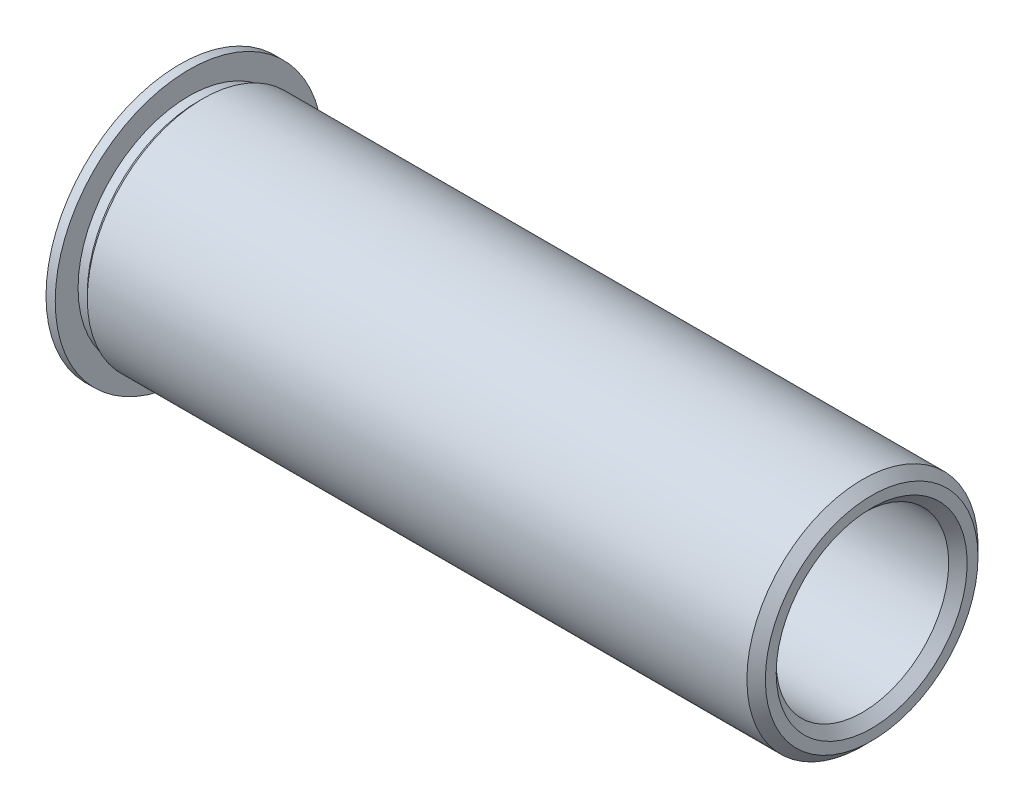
from build123d import *

# Parameters (mm, degrees)
SKETCH3_R          = 2.3749
CUT_EXTRUDE1_DEPTH = 102.004224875
CHAMFER2_SIZE      = 0.254
CHAMFER3_SIZE      = 0.254


with BuildPart() as part:
    # Sketch2 → Revolve3 (revolve)
    with BuildSketch(Plane.XY, mode=Mode.PRIVATE) as revolve3_sk:
        Polygon((-64.141082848, 95.440087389), (-64.141082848, 99.123087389), (-63.887082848, 99.123087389), (-63.887082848, 98.494437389), (-63.633082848, 98.494437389), (-63.506082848, 98.621437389), (-45.345082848, 98.621437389), (-45.091082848, 98.367437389), (-45.091082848, 95.440087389), align=None)
    revolve(revolve3_sk.sketch.rotate(Axis((-64.141082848, 95.440087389, 0), (1, 0, 0)), 90), axis=Axis((-64.141082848, 95.440087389, 0), (1, 0, 0)))

    # Sketch3 → Cut-Extrude1 (cut, through all)
    with BuildSketch(Plane(origin=(-45.091082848, 0, 0), x_dir=(0, 0, -1), z_dir=(1, 0, 0))):
        with Locations((0, 95.440087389)):
            Circle(SKETCH3_R)
    extrude(amount=-CUT_EXTRUDE1_DEPTH, mode=Mode.SUBTRACT)

    # Chamfer2
    chamfer2_edges = [part.edges().sort_by_distance(p)[0] for p in [
        (-64.141082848, 95.440087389, 2.3749),
    ]]
    chamfer(chamfer2_edges, length=CHAMFER2_SIZE)

    # Chamfer3
    chamfer3_edges = [part.edges().sort_by_distance(p)[0] for p in [
        (-45.091082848, 95.440087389, 2.3749),
    ]]
    chamfer(chamfer3_edges, length=CHAMFER3_SIZE)


solid = part.part
